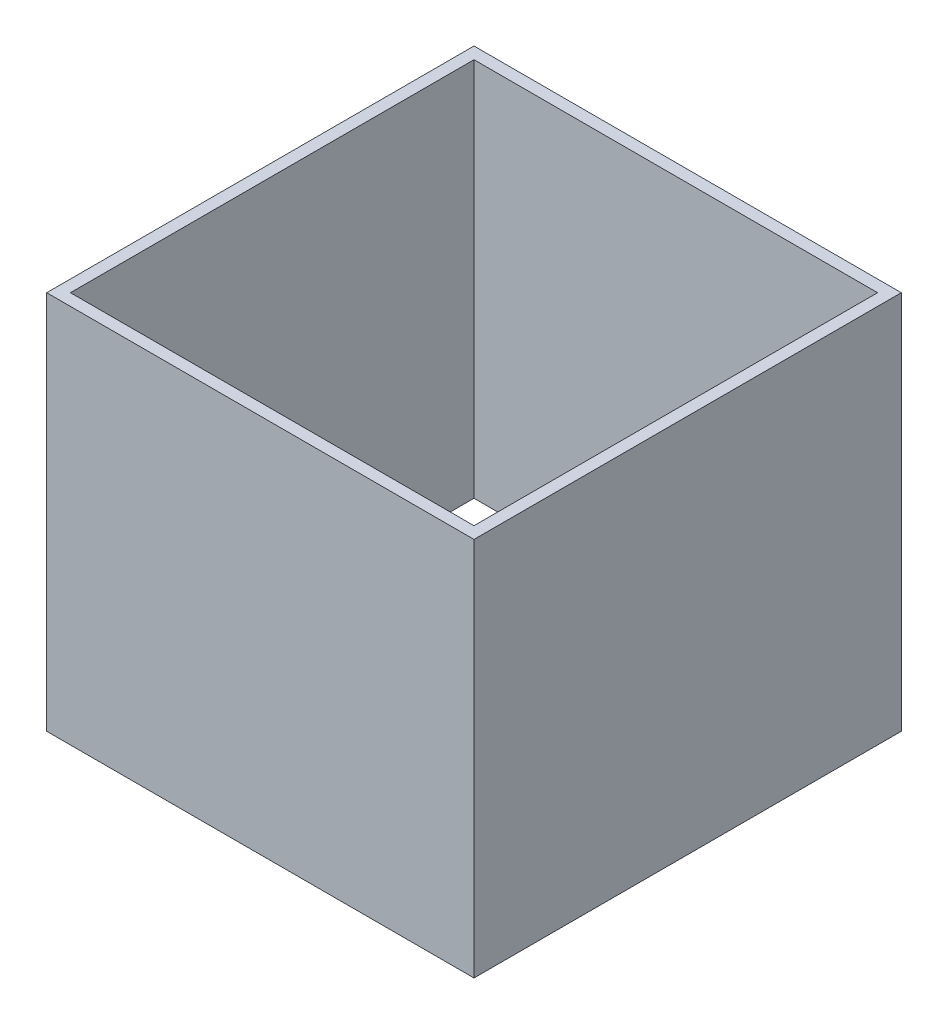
ISO-10303-21;
HEADER;
FILE_DESCRIPTION(('STEP AP214'),'2;1');
FILE_NAME('part.step','',(''),(''),'','','');
FILE_SCHEMA(('AUTOMOTIVE_DESIGN { 1 0 10303 214 1 1 1 1 }'));
ENDSEC;
DATA;
#1=APPLICATION_CONTEXT('core data for automotive mechanical design processes');
#2=APPLICATION_PROTOCOL_DEFINITION('international standard','automotive_design',2000,#1);
#3=PRODUCT_CONTEXT('',#1,'mechanical');
#4=PRODUCT('Part','Part','',(#3));
#5=PRODUCT_RELATED_PRODUCT_CATEGORY('part','',(#4));
#6=PRODUCT_DEFINITION_FORMATION('','',#4);
#7=PRODUCT_DEFINITION_CONTEXT('part definition',#1,'design');
#8=PRODUCT_DEFINITION('design','',#6,#7);
#9=PRODUCT_DEFINITION_SHAPE('','',#8);
#10=(LENGTH_UNIT() NAMED_UNIT(*) SI_UNIT(.MILLI.,.METRE.));
#11=(NAMED_UNIT(*) PLANE_ANGLE_UNIT() SI_UNIT($,.RADIAN.));
#12=(NAMED_UNIT(*) SI_UNIT($,.STERADIAN.) SOLID_ANGLE_UNIT());
#13=UNCERTAINTY_MEASURE_WITH_UNIT(LENGTH_MEASURE(1.E-05),#10,'distance_accuracy_value','');
#14=(GEOMETRIC_REPRESENTATION_CONTEXT(3) GLOBAL_UNCERTAINTY_ASSIGNED_CONTEXT((#13)) GLOBAL_UNIT_ASSIGNED_CONTEXT((#10,
#11,#12)) REPRESENTATION_CONTEXT('',''));
#15=CARTESIAN_POINT('',(0.,0.,0.));
#16=DIRECTION('',(0.,0.,1.));
#17=DIRECTION('',(1.,0.,0.));
#18=AXIS2_PLACEMENT_3D('',#15,#16,#17);
#19=CARTESIAN_POINT('',(0.,160.,0.));
#20=DIRECTION('',(0.,-1.,0.));
#21=DIRECTION('',(0.,0.,-1.));
#22=AXIS2_PLACEMENT_3D('',#19,#20,#21);
#23=PLANE('',#22);
#24=DIRECTION('',(0.,0.,1.));
#25=VECTOR('',#24,1.);
#26=CARTESIAN_POINT('',(0.,160.,0.));
#27=LINE('',#26,#25);
#28=CARTESIAN_POINT('',(0.,160.,-180.));
#29=VERTEX_POINT('',#28);
#30=CARTESIAN_POINT('',(0.,160.,0.));
#31=VERTEX_POINT('',#30);
#32=EDGE_CURVE('E137',#29,#31,#27,.T.);
#33=ORIENTED_EDGE('',*,*,#32,.T.);
#34=DIRECTION('',(1.,0.,0.));
#35=VECTOR('',#34,1.);
#36=CARTESIAN_POINT('',(0.,160.,0.));
#37=LINE('',#36,#35);
#38=CARTESIAN_POINT('',(180.,160.,0.));
#39=VERTEX_POINT('',#38);
#40=EDGE_CURVE('E140',#31,#39,#37,.T.);
#41=ORIENTED_EDGE('',*,*,#40,.T.);
#42=DIRECTION('',(0.,0.,-1.));
#43=VECTOR('',#42,1.);
#44=CARTESIAN_POINT('',(180.,160.,0.));
#45=LINE('',#44,#43);
#46=CARTESIAN_POINT('',(180.,160.,-180.));
#47=VERTEX_POINT('',#46);
#48=EDGE_CURVE('E143',#39,#47,#45,.T.);
#49=ORIENTED_EDGE('',*,*,#48,.T.);
#50=DIRECTION('',(-1.,0.,0.));
#51=VECTOR('',#50,1.);
#52=CARTESIAN_POINT('',(0.,160.,-180.));
#53=LINE('',#52,#51);
#54=EDGE_CURVE('E145',#47,#29,#53,.T.);
#55=ORIENTED_EDGE('',*,*,#54,.T.);
#56=EDGE_LOOP('',(#33,#41,#49,#55));
#57=FACE_BOUND('',#56,.T.);
#58=DIRECTION('',(0.,0.,1.));
#59=VECTOR('',#58,1.);
#60=CARTESIAN_POINT('',(5.,160.,-5.));
#61=LINE('',#60,#59);
#62=CARTESIAN_POINT('',(4.99999999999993,160.,-175.));
#63=VERTEX_POINT('',#62);
#64=CARTESIAN_POINT('',(5.,160.,-5.));
#65=VERTEX_POINT('',#64);
#66=EDGE_CURVE('E101',#63,#65,#61,.T.);
#67=ORIENTED_EDGE('',*,*,#66,.F.);
#68=DIRECTION('',(-1.,0.,0.));
#69=VECTOR('',#68,1.);
#70=CARTESIAN_POINT('',(4.99999999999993,160.,-175.));
#71=LINE('',#70,#69);
#72=CARTESIAN_POINT('',(175.,160.,-175.));
#73=VERTEX_POINT('',#72);
#74=EDGE_CURVE('E123',#73,#63,#71,.T.);
#75=ORIENTED_EDGE('',*,*,#74,.F.);
#76=DIRECTION('',(0.,0.,-1.));
#77=VECTOR('',#76,1.);
#78=CARTESIAN_POINT('',(175.,160.,-5.));
#79=LINE('',#78,#77);
#80=CARTESIAN_POINT('',(175.,160.,-5.));
#81=VERTEX_POINT('',#80);
#82=EDGE_CURVE('E121',#81,#73,#79,.T.);
#83=ORIENTED_EDGE('',*,*,#82,.F.);
#84=DIRECTION('',(1.,0.,0.));
#85=VECTOR('',#84,1.);
#86=CARTESIAN_POINT('',(5.,160.,-5.));
#87=LINE('',#86,#85);
#88=EDGE_CURVE('E109',#65,#81,#87,.T.);
#89=ORIENTED_EDGE('',*,*,#88,.F.);
#90=EDGE_LOOP('',(#67,#75,#83,#89));
#91=FACE_BOUND('',#90,.T.);
#92=ADVANCED_FACE('F36',(#57,#91),#23,.F.);
#93=CARTESIAN_POINT('',(0.,0.,0.));
#94=DIRECTION('',(0.,-1.,0.));
#95=DIRECTION('',(0.,0.,-1.));
#96=AXIS2_PLACEMENT_3D('',#93,#94,#95);
#97=PLANE('',#96);
#98=DIRECTION('',(0.,0.,1.));
#99=VECTOR('',#98,1.);
#100=CARTESIAN_POINT('',(0.,0.,0.));
#101=LINE('',#100,#99);
#102=CARTESIAN_POINT('',(0.,0.,-180.));
#103=VERTEX_POINT('',#102);
#104=CARTESIAN_POINT('',(0.,0.,0.));
#105=VERTEX_POINT('',#104);
#106=EDGE_CURVE('E117',#103,#105,#101,.T.);
#107=ORIENTED_EDGE('',*,*,#106,.F.);
#108=DIRECTION('',(-1.,0.,0.));
#109=VECTOR('',#108,1.);
#110=CARTESIAN_POINT('',(0.,0.,-180.));
#111=LINE('',#110,#109);
#112=CARTESIAN_POINT('',(180.,0.,-180.));
#113=VERTEX_POINT('',#112);
#114=EDGE_CURVE('E141',#113,#103,#111,.T.);
#115=ORIENTED_EDGE('',*,*,#114,.F.);
#116=DIRECTION('',(0.,0.,-1.));
#117=VECTOR('',#116,1.);
#118=CARTESIAN_POINT('',(180.,0.,0.));
#119=LINE('',#118,#117);
#120=CARTESIAN_POINT('',(180.,0.,0.));
#121=VERTEX_POINT('',#120);
#122=EDGE_CURVE('E152',#121,#113,#119,.T.);
#123=ORIENTED_EDGE('',*,*,#122,.F.);
#124=DIRECTION('',(1.,0.,0.));
#125=VECTOR('',#124,1.);
#126=CARTESIAN_POINT('',(0.,0.,0.));
#127=LINE('',#126,#125);
#128=EDGE_CURVE('E150',#105,#121,#127,.T.);
#129=ORIENTED_EDGE('',*,*,#128,.F.);
#130=EDGE_LOOP('',(#107,#115,#123,#129));
#131=FACE_BOUND('',#130,.T.);
#132=DIRECTION('',(-1.,0.,0.));
#133=VECTOR('',#132,1.);
#134=CARTESIAN_POINT('',(4.99999999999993,0.,-175.));
#135=LINE('',#134,#133);
#136=CARTESIAN_POINT('',(175.,0.,-175.));
#137=VERTEX_POINT('',#136);
#138=CARTESIAN_POINT('',(4.99999999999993,0.,-175.));
#139=VERTEX_POINT('',#138);
#140=EDGE_CURVE('E110',#137,#139,#135,.T.);
#141=ORIENTED_EDGE('',*,*,#140,.T.);
#142=DIRECTION('',(0.,0.,1.));
#143=VECTOR('',#142,1.);
#144=CARTESIAN_POINT('',(5.,0.,-5.));
#145=LINE('',#144,#143);
#146=CARTESIAN_POINT('',(5.,0.,-5.));
#147=VERTEX_POINT('',#146);
#148=EDGE_CURVE('E59',#139,#147,#145,.T.);
#149=ORIENTED_EDGE('',*,*,#148,.T.);
#150=DIRECTION('',(1.,0.,0.));
#151=VECTOR('',#150,1.);
#152=CARTESIAN_POINT('',(5.,0.,-5.));
#153=LINE('',#152,#151);
#154=CARTESIAN_POINT('',(175.,0.,-5.));
#155=VERTEX_POINT('',#154);
#156=EDGE_CURVE('E116',#147,#155,#153,.T.);
#157=ORIENTED_EDGE('',*,*,#156,.T.);
#158=DIRECTION('',(0.,0.,-1.));
#159=VECTOR('',#158,1.);
#160=CARTESIAN_POINT('',(175.,0.,-5.));
#161=LINE('',#160,#159);
#162=EDGE_CURVE('E129',#155,#137,#161,.T.);
#163=ORIENTED_EDGE('',*,*,#162,.T.);
#164=EDGE_LOOP('',(#141,#149,#157,#163));
#165=FACE_BOUND('',#164,.T.);
#166=ADVANCED_FACE('F170',(#131,#165),#97,.T.);
#167=CARTESIAN_POINT('',(0.,160.,0.));
#168=DIRECTION('',(1.,0.,0.));
#169=DIRECTION('',(0.,0.,-1.));
#170=AXIS2_PLACEMENT_3D('',#167,#168,#169);
#171=PLANE('',#170);
#172=ORIENTED_EDGE('',*,*,#106,.T.);
#173=DIRECTION('',(0.,-1.,0.));
#174=VECTOR('',#173,1.);
#175=CARTESIAN_POINT('',(0.,160.,0.));
#176=LINE('',#175,#174);
#177=EDGE_CURVE('E11',#31,#105,#176,.T.);
#178=ORIENTED_EDGE('',*,*,#177,.F.);
#179=ORIENTED_EDGE('',*,*,#32,.F.);
#180=DIRECTION('',(0.,-1.,0.));
#181=VECTOR('',#180,1.);
#182=CARTESIAN_POINT('',(0.,160.,-180.));
#183=LINE('',#182,#181);
#184=EDGE_CURVE('E147',#29,#103,#183,.T.);
#185=ORIENTED_EDGE('',*,*,#184,.T.);
#186=EDGE_LOOP('',(#172,#178,#179,#185));
#187=FACE_BOUND('',#186,.T.);
#188=ADVANCED_FACE('F38',(#187),#171,.F.);
#189=CARTESIAN_POINT('',(0.,160.,0.));
#190=DIRECTION('',(0.,0.,-1.));
#191=DIRECTION('',(-1.,0.,0.));
#192=AXIS2_PLACEMENT_3D('',#189,#190,#191);
#193=PLANE('',#192);
#194=ORIENTED_EDGE('',*,*,#128,.T.);
#195=DIRECTION('',(0.,-1.,0.));
#196=VECTOR('',#195,1.);
#197=CARTESIAN_POINT('',(180.,160.,0.));
#198=LINE('',#197,#196);
#199=EDGE_CURVE('E44',#39,#121,#198,.T.);
#200=ORIENTED_EDGE('',*,*,#199,.F.);
#201=ORIENTED_EDGE('',*,*,#40,.F.);
#202=ORIENTED_EDGE('',*,*,#177,.T.);
#203=EDGE_LOOP('',(#194,#200,#201,#202));
#204=FACE_BOUND('',#203,.T.);
#205=ADVANCED_FACE('F180',(#204),#193,.F.);
#206=CARTESIAN_POINT('',(180.,160.,0.));
#207=DIRECTION('',(-1.,0.,0.));
#208=DIRECTION('',(0.,0.,1.));
#209=AXIS2_PLACEMENT_3D('',#206,#207,#208);
#210=PLANE('',#209);
#211=ORIENTED_EDGE('',*,*,#122,.T.);
#212=DIRECTION('',(0.,-1.,0.));
#213=VECTOR('',#212,1.);
#214=CARTESIAN_POINT('',(180.,160.,-180.));
#215=LINE('',#214,#213);
#216=EDGE_CURVE('E157',#47,#113,#215,.T.);
#217=ORIENTED_EDGE('',*,*,#216,.F.);
#218=ORIENTED_EDGE('',*,*,#48,.F.);
#219=ORIENTED_EDGE('',*,*,#199,.T.);
#220=EDGE_LOOP('',(#211,#217,#218,#219));
#221=FACE_BOUND('',#220,.T.);
#222=ADVANCED_FACE('F164',(#221),#210,.F.);
#223=CARTESIAN_POINT('',(0.,160.,-180.));
#224=DIRECTION('',(0.,0.,1.));
#225=DIRECTION('',(1.,0.,0.));
#226=AXIS2_PLACEMENT_3D('',#223,#224,#225);
#227=PLANE('',#226);
#228=ORIENTED_EDGE('',*,*,#114,.T.);
#229=ORIENTED_EDGE('',*,*,#184,.F.);
#230=ORIENTED_EDGE('',*,*,#54,.F.);
#231=ORIENTED_EDGE('',*,*,#216,.T.);
#232=EDGE_LOOP('',(#228,#229,#230,#231));
#233=FACE_BOUND('',#232,.T.);
#234=ADVANCED_FACE('F174',(#233),#227,.F.);
#235=CARTESIAN_POINT('',(5.,160.,-5.));
#236=DIRECTION('',(1.,0.,0.));
#237=DIRECTION('',(0.,0.,-1.));
#238=AXIS2_PLACEMENT_3D('',#235,#236,#237);
#239=PLANE('',#238);
#240=ORIENTED_EDGE('',*,*,#148,.F.);
#241=DIRECTION('',(0.,-1.,0.));
#242=VECTOR('',#241,1.);
#243=CARTESIAN_POINT('',(4.99999999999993,160.,-175.));
#244=LINE('',#243,#242);
#245=EDGE_CURVE('E105',#63,#139,#244,.T.);
#246=ORIENTED_EDGE('',*,*,#245,.F.);
#247=ORIENTED_EDGE('',*,*,#66,.T.);
#248=DIRECTION('',(0.,-1.,0.));
#249=VECTOR('',#248,1.);
#250=CARTESIAN_POINT('',(5.,160.,-5.));
#251=LINE('',#250,#249);
#252=EDGE_CURVE('E104',#65,#147,#251,.T.);
#253=ORIENTED_EDGE('',*,*,#252,.T.);
#254=EDGE_LOOP('',(#240,#246,#247,#253));
#255=FACE_BOUND('',#254,.T.);
#256=ADVANCED_FACE('F103',(#255),#239,.T.);
#257=CARTESIAN_POINT('',(5.,160.,-5.));
#258=DIRECTION('',(0.,0.,-1.));
#259=DIRECTION('',(-1.,0.,0.));
#260=AXIS2_PLACEMENT_3D('',#257,#258,#259);
#261=PLANE('',#260);
#262=ORIENTED_EDGE('',*,*,#156,.F.);
#263=ORIENTED_EDGE('',*,*,#252,.F.);
#264=ORIENTED_EDGE('',*,*,#88,.T.);
#265=DIRECTION('',(0.,-1.,0.));
#266=VECTOR('',#265,1.);
#267=CARTESIAN_POINT('',(175.,160.,-5.));
#268=LINE('',#267,#266);
#269=EDGE_CURVE('E118',#81,#155,#268,.T.);
#270=ORIENTED_EDGE('',*,*,#269,.T.);
#271=EDGE_LOOP('',(#262,#263,#264,#270));
#272=FACE_BOUND('',#271,.T.);
#273=ADVANCED_FACE('F113',(#272),#261,.T.);
#274=CARTESIAN_POINT('',(175.,160.,-5.));
#275=DIRECTION('',(-1.,0.,0.));
#276=DIRECTION('',(0.,0.,1.));
#277=AXIS2_PLACEMENT_3D('',#274,#275,#276);
#278=PLANE('',#277);
#279=ORIENTED_EDGE('',*,*,#162,.F.);
#280=ORIENTED_EDGE('',*,*,#269,.F.);
#281=ORIENTED_EDGE('',*,*,#82,.T.);
#282=DIRECTION('',(0.,-1.,0.));
#283=VECTOR('',#282,1.);
#284=CARTESIAN_POINT('',(175.,160.,-175.));
#285=LINE('',#284,#283);
#286=EDGE_CURVE('E51',#73,#137,#285,.T.);
#287=ORIENTED_EDGE('',*,*,#286,.T.);
#288=EDGE_LOOP('',(#279,#280,#281,#287));
#289=FACE_BOUND('',#288,.T.);
#290=ADVANCED_FACE('F202',(#289),#278,.T.);
#291=CARTESIAN_POINT('',(4.99999999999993,160.,-175.));
#292=DIRECTION('',(0.,0.,1.));
#293=DIRECTION('',(1.,0.,0.));
#294=AXIS2_PLACEMENT_3D('',#291,#292,#293);
#295=PLANE('',#294);
#296=ORIENTED_EDGE('',*,*,#140,.F.);
#297=ORIENTED_EDGE('',*,*,#286,.F.);
#298=ORIENTED_EDGE('',*,*,#74,.T.);
#299=ORIENTED_EDGE('',*,*,#245,.T.);
#300=EDGE_LOOP('',(#296,#297,#298,#299));
#301=FACE_BOUND('',#300,.T.);
#302=ADVANCED_FACE('F206',(#301),#295,.T.);
#303=CLOSED_SHELL('',(#92,#166,#188,#205,#222,#234,#256,#273,#290,#302));
#304=MANIFOLD_SOLID_BREP('B2',#303);
#305=ADVANCED_BREP_SHAPE_REPRESENTATION('',(#18,#304),#14);
#306=SHAPE_DEFINITION_REPRESENTATION(#9,#305);
ENDSEC;
END-ISO-10303-21;
